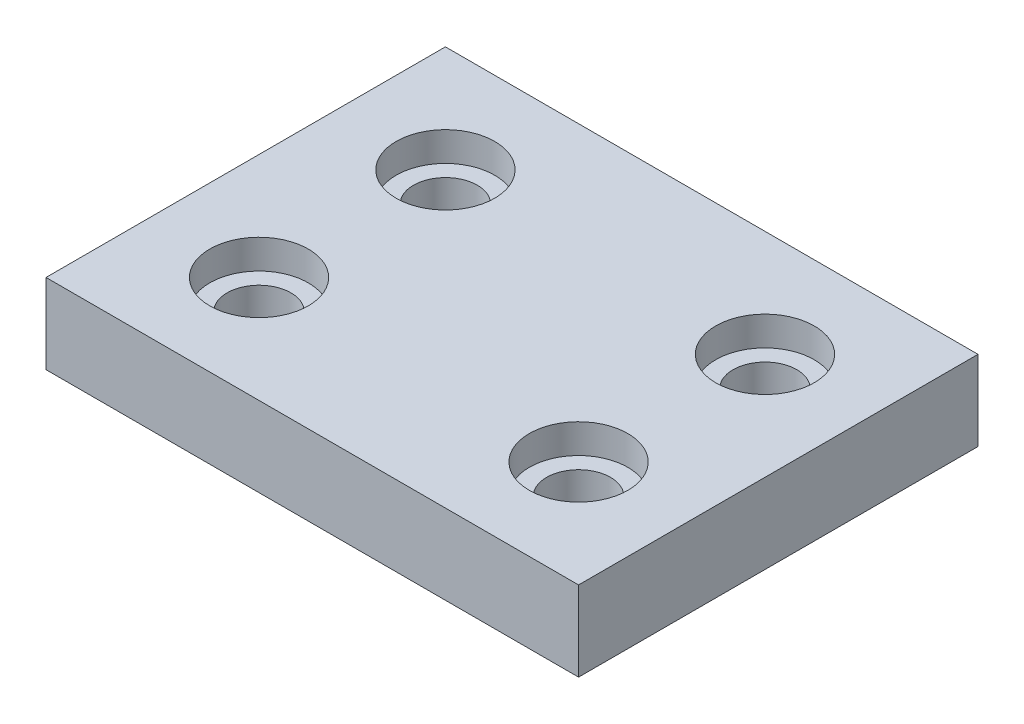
ISO-10303-21;
HEADER;
FILE_DESCRIPTION(('STEP AP214'),'2;1');
FILE_NAME('part.step','',(''),(''),'','','');
FILE_SCHEMA(('AUTOMOTIVE_DESIGN { 1 0 10303 214 1 1 1 1 }'));
ENDSEC;
DATA;
#1=APPLICATION_CONTEXT('core data for automotive mechanical design processes');
#2=APPLICATION_PROTOCOL_DEFINITION('international standard','automotive_design',2000,#1);
#3=PRODUCT_CONTEXT('',#1,'mechanical');
#4=PRODUCT('Part','Part','',(#3));
#5=PRODUCT_RELATED_PRODUCT_CATEGORY('part','',(#4));
#6=PRODUCT_DEFINITION_FORMATION('','',#4);
#7=PRODUCT_DEFINITION_CONTEXT('part definition',#1,'design');
#8=PRODUCT_DEFINITION('design','',#6,#7);
#9=PRODUCT_DEFINITION_SHAPE('','',#8);
#10=(LENGTH_UNIT() NAMED_UNIT(*) SI_UNIT(.MILLI.,.METRE.));
#11=(NAMED_UNIT(*) PLANE_ANGLE_UNIT() SI_UNIT($,.RADIAN.));
#12=(NAMED_UNIT(*) SI_UNIT($,.STERADIAN.) SOLID_ANGLE_UNIT());
#13=UNCERTAINTY_MEASURE_WITH_UNIT(LENGTH_MEASURE(1.E-05),#10,'distance_accuracy_value','');
#14=(GEOMETRIC_REPRESENTATION_CONTEXT(3) GLOBAL_UNCERTAINTY_ASSIGNED_CONTEXT((#13)) GLOBAL_UNIT_ASSIGNED_CONTEXT((#10,
#11,#12)) REPRESENTATION_CONTEXT('',''));
#15=CARTESIAN_POINT('',(0.,0.,0.));
#16=DIRECTION('',(0.,0.,1.));
#17=DIRECTION('',(1.,0.,0.));
#18=AXIS2_PLACEMENT_3D('',#15,#16,#17);
#19=CARTESIAN_POINT('',(50.,15.,37.5));
#20=DIRECTION('',(-1.,0.,0.));
#21=DIRECTION('',(0.,0.,1.));
#22=AXIS2_PLACEMENT_3D('',#19,#20,#21);
#23=PLANE('',#22);
#24=DIRECTION('',(0.,0.,-1.));
#25=VECTOR('',#24,1.);
#26=CARTESIAN_POINT('',(50.,0.,37.5));
#27=LINE('',#26,#25);
#28=CARTESIAN_POINT('',(50.,0.,37.5));
#29=VERTEX_POINT('',#28);
#30=CARTESIAN_POINT('',(50.,0.,-37.5));
#31=VERTEX_POINT('',#30);
#32=EDGE_CURVE('E97',#29,#31,#27,.T.);
#33=ORIENTED_EDGE('',*,*,#32,.T.);
#34=DIRECTION('',(0.,-1.,0.));
#35=VECTOR('',#34,1.);
#36=CARTESIAN_POINT('',(50.,15.,-37.5));
#37=LINE('',#36,#35);
#38=CARTESIAN_POINT('',(50.,15.,-37.5));
#39=VERTEX_POINT('',#38);
#40=EDGE_CURVE('E11',#39,#31,#37,.T.);
#41=ORIENTED_EDGE('',*,*,#40,.F.);
#42=DIRECTION('',(0.,0.,-1.));
#43=VECTOR('',#42,1.);
#44=CARTESIAN_POINT('',(50.,15.,37.5));
#45=LINE('',#44,#43);
#46=CARTESIAN_POINT('',(50.,15.,37.5));
#47=VERTEX_POINT('',#46);
#48=EDGE_CURVE('E85',#47,#39,#45,.T.);
#49=ORIENTED_EDGE('',*,*,#48,.F.);
#50=DIRECTION('',(0.,-1.,0.));
#51=VECTOR('',#50,1.);
#52=CARTESIAN_POINT('',(50.,15.,37.5));
#53=LINE('',#52,#51);
#54=EDGE_CURVE('E93',#47,#29,#53,.T.);
#55=ORIENTED_EDGE('',*,*,#54,.T.);
#56=EDGE_LOOP('',(#33,#41,#49,#55));
#57=FACE_BOUND('',#56,.T.);
#58=ADVANCED_FACE('F34',(#57),#23,.F.);
#59=CARTESIAN_POINT('',(-50.,15.,-37.5));
#60=DIRECTION('',(0.,0.,1.));
#61=DIRECTION('',(1.,0.,0.));
#62=AXIS2_PLACEMENT_3D('',#59,#60,#61);
#63=PLANE('',#62);
#64=DIRECTION('',(-1.,0.,0.));
#65=VECTOR('',#64,1.);
#66=CARTESIAN_POINT('',(-50.,0.,-37.5));
#67=LINE('',#66,#65);
#68=CARTESIAN_POINT('',(-50.,0.,-37.5));
#69=VERTEX_POINT('',#68);
#70=EDGE_CURVE('E89',#31,#69,#67,.T.);
#71=ORIENTED_EDGE('',*,*,#70,.T.);
#72=DIRECTION('',(0.,-1.,0.));
#73=VECTOR('',#72,1.);
#74=CARTESIAN_POINT('',(-50.,15.,-37.5));
#75=LINE('',#74,#73);
#76=CARTESIAN_POINT('',(-50.,15.,-37.5));
#77=VERTEX_POINT('',#76);
#78=EDGE_CURVE('E42',#77,#69,#75,.T.);
#79=ORIENTED_EDGE('',*,*,#78,.F.);
#80=DIRECTION('',(-1.,0.,0.));
#81=VECTOR('',#80,1.);
#82=CARTESIAN_POINT('',(-50.,15.,-37.5));
#83=LINE('',#82,#81);
#84=EDGE_CURVE('E80',#39,#77,#83,.T.);
#85=ORIENTED_EDGE('',*,*,#84,.F.);
#86=ORIENTED_EDGE('',*,*,#40,.T.);
#87=EDGE_LOOP('',(#71,#79,#85,#86));
#88=FACE_BOUND('',#87,.T.);
#89=ADVANCED_FACE('F88',(#88),#63,.F.);
#90=CARTESIAN_POINT('',(-50.,15.,37.5));
#91=DIRECTION('',(1.,0.,0.));
#92=DIRECTION('',(0.,0.,-1.));
#93=AXIS2_PLACEMENT_3D('',#90,#91,#92);
#94=PLANE('',#93);
#95=DIRECTION('',(0.,0.,1.));
#96=VECTOR('',#95,1.);
#97=CARTESIAN_POINT('',(-50.,0.,37.5));
#98=LINE('',#97,#96);
#99=CARTESIAN_POINT('',(-50.,0.,37.5));
#100=VERTEX_POINT('',#99);
#101=EDGE_CURVE('E67',#69,#100,#98,.T.);
#102=ORIENTED_EDGE('',*,*,#101,.T.);
#103=DIRECTION('',(0.,-1.,0.));
#104=VECTOR('',#103,1.);
#105=CARTESIAN_POINT('',(-50.,15.,37.5));
#106=LINE('',#105,#104);
#107=CARTESIAN_POINT('',(-50.,15.,37.5));
#108=VERTEX_POINT('',#107);
#109=EDGE_CURVE('E90',#108,#100,#106,.T.);
#110=ORIENTED_EDGE('',*,*,#109,.F.);
#111=DIRECTION('',(0.,0.,1.));
#112=VECTOR('',#111,1.);
#113=CARTESIAN_POINT('',(-50.,15.,37.5));
#114=LINE('',#113,#112);
#115=EDGE_CURVE('E83',#77,#108,#114,.T.);
#116=ORIENTED_EDGE('',*,*,#115,.F.);
#117=ORIENTED_EDGE('',*,*,#78,.T.);
#118=EDGE_LOOP('',(#102,#110,#116,#117));
#119=FACE_BOUND('',#118,.T.);
#120=ADVANCED_FACE('F91',(#119),#94,.F.);
#121=CARTESIAN_POINT('',(-50.,15.,37.5));
#122=DIRECTION('',(0.,0.,-1.));
#123=DIRECTION('',(-1.,0.,0.));
#124=AXIS2_PLACEMENT_3D('',#121,#122,#123);
#125=PLANE('',#124);
#126=DIRECTION('',(1.,0.,0.));
#127=VECTOR('',#126,1.);
#128=CARTESIAN_POINT('',(-50.,0.,37.5));
#129=LINE('',#128,#127);
#130=EDGE_CURVE('E73',#100,#29,#129,.T.);
#131=ORIENTED_EDGE('',*,*,#130,.T.);
#132=ORIENTED_EDGE('',*,*,#54,.F.);
#133=DIRECTION('',(1.,0.,0.));
#134=VECTOR('',#133,1.);
#135=CARTESIAN_POINT('',(-50.,15.,37.5));
#136=LINE('',#135,#134);
#137=EDGE_CURVE('E50',#108,#47,#136,.T.);
#138=ORIENTED_EDGE('',*,*,#137,.F.);
#139=ORIENTED_EDGE('',*,*,#109,.T.);
#140=EDGE_LOOP('',(#131,#132,#138,#139));
#141=FACE_BOUND('',#140,.T.);
#142=ADVANCED_FACE('F105',(#141),#125,.F.);
#143=CARTESIAN_POINT('',(0.,15.,0.));
#144=DIRECTION('',(0.,-1.,0.));
#145=DIRECTION('',(0.,0.,-1.));
#146=AXIS2_PLACEMENT_3D('',#143,#144,#145);
#147=PLANE('',#146);
#148=CARTESIAN_POINT('',(-30.,15.,17.5));
#149=DIRECTION('',(0.,1.,0.));
#150=DIRECTION('',(0.,0.,1.));
#151=AXIS2_PLACEMENT_3D('',#148,#149,#150);
#152=CIRCLE('',#151,9.24999999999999);
#153=CARTESIAN_POINT('',(-30.,15.,26.75));
#154=VERTEX_POINT('',#153);
#155=EDGE_CURVE('E155',#154,#154,#152,.T.);
#156=ORIENTED_EDGE('',*,*,#155,.F.);
#157=EDGE_LOOP('',(#156));
#158=FACE_BOUND('',#157,.T.);
#159=CARTESIAN_POINT('',(-30.,15.,-17.5));
#160=DIRECTION('',(0.,1.,0.));
#161=DIRECTION('',(0.,0.,1.));
#162=AXIS2_PLACEMENT_3D('',#159,#160,#161);
#163=CIRCLE('',#162,9.24999999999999);
#164=CARTESIAN_POINT('',(-30.,15.,-8.25));
#165=VERTEX_POINT('',#164);
#166=EDGE_CURVE('E143',#165,#165,#163,.T.);
#167=ORIENTED_EDGE('',*,*,#166,.F.);
#168=EDGE_LOOP('',(#167));
#169=FACE_BOUND('',#168,.T.);
#170=CARTESIAN_POINT('',(30.,15.,-17.5));
#171=DIRECTION('',(0.,1.,0.));
#172=DIRECTION('',(0.,0.,1.));
#173=AXIS2_PLACEMENT_3D('',#170,#171,#172);
#174=CIRCLE('',#173,9.25);
#175=CARTESIAN_POINT('',(30.,15.,-8.25));
#176=VERTEX_POINT('',#175);
#177=EDGE_CURVE('E131',#176,#176,#174,.T.);
#178=ORIENTED_EDGE('',*,*,#177,.F.);
#179=EDGE_LOOP('',(#178));
#180=FACE_BOUND('',#179,.T.);
#181=CARTESIAN_POINT('',(30.,15.,17.5));
#182=DIRECTION('',(0.,1.,0.));
#183=DIRECTION('',(0.,0.,1.));
#184=AXIS2_PLACEMENT_3D('',#181,#182,#183);
#185=CIRCLE('',#184,9.25);
#186=CARTESIAN_POINT('',(30.,15.,26.75));
#187=VERTEX_POINT('',#186);
#188=EDGE_CURVE('E119',#187,#187,#185,.T.);
#189=ORIENTED_EDGE('',*,*,#188,.F.);
#190=EDGE_LOOP('',(#189));
#191=FACE_BOUND('',#190,.T.);
#192=ORIENTED_EDGE('',*,*,#48,.T.);
#193=ORIENTED_EDGE('',*,*,#84,.T.);
#194=ORIENTED_EDGE('',*,*,#115,.T.);
#195=ORIENTED_EDGE('',*,*,#137,.T.);
#196=EDGE_LOOP('',(#192,#193,#194,#195));
#197=FACE_BOUND('',#196,.T.);
#198=ADVANCED_FACE('F81',(#158,#169,#180,#191,#197),#147,.F.);
#199=CARTESIAN_POINT('',(0.,0.,0.));
#200=DIRECTION('',(0.,-1.,0.));
#201=DIRECTION('',(0.,0.,-1.));
#202=AXIS2_PLACEMENT_3D('',#199,#200,#201);
#203=PLANE('',#202);
#204=CARTESIAN_POINT('',(-30.,0.,17.5));
#205=DIRECTION('',(0.,1.,0.));
#206=DIRECTION('',(0.,0.,1.));
#207=AXIS2_PLACEMENT_3D('',#204,#205,#206);
#208=CIRCLE('',#207,5.99999999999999);
#209=CARTESIAN_POINT('',(-30.,0.,23.5));
#210=VERTEX_POINT('',#209);
#211=EDGE_CURVE('E146',#210,#210,#208,.T.);
#212=ORIENTED_EDGE('',*,*,#211,.T.);
#213=EDGE_LOOP('',(#212));
#214=FACE_BOUND('',#213,.T.);
#215=CARTESIAN_POINT('',(-30.,0.,-17.5));
#216=DIRECTION('',(0.,1.,0.));
#217=DIRECTION('',(0.,0.,1.));
#218=AXIS2_PLACEMENT_3D('',#215,#216,#217);
#219=CIRCLE('',#218,6.);
#220=CARTESIAN_POINT('',(-30.,0.,-11.5));
#221=VERTEX_POINT('',#220);
#222=EDGE_CURVE('E134',#221,#221,#219,.T.);
#223=ORIENTED_EDGE('',*,*,#222,.T.);
#224=EDGE_LOOP('',(#223));
#225=FACE_BOUND('',#224,.T.);
#226=CARTESIAN_POINT('',(30.,0.,-17.5));
#227=DIRECTION('',(0.,1.,0.));
#228=DIRECTION('',(0.,0.,1.));
#229=AXIS2_PLACEMENT_3D('',#226,#227,#228);
#230=CIRCLE('',#229,5.99999999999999);
#231=CARTESIAN_POINT('',(30.,0.,-11.5));
#232=VERTEX_POINT('',#231);
#233=EDGE_CURVE('E122',#232,#232,#230,.T.);
#234=ORIENTED_EDGE('',*,*,#233,.T.);
#235=EDGE_LOOP('',(#234));
#236=FACE_BOUND('',#235,.T.);
#237=CARTESIAN_POINT('',(30.,0.,17.5));
#238=DIRECTION('',(0.,1.,0.));
#239=DIRECTION('',(0.,0.,1.));
#240=AXIS2_PLACEMENT_3D('',#237,#238,#239);
#241=CIRCLE('',#240,5.99999999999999);
#242=CARTESIAN_POINT('',(30.,0.,23.5));
#243=VERTEX_POINT('',#242);
#244=EDGE_CURVE('E100',#243,#243,#241,.T.);
#245=ORIENTED_EDGE('',*,*,#244,.T.);
#246=EDGE_LOOP('',(#245));
#247=FACE_BOUND('',#246,.T.);
#248=ORIENTED_EDGE('',*,*,#32,.F.);
#249=ORIENTED_EDGE('',*,*,#130,.F.);
#250=ORIENTED_EDGE('',*,*,#101,.F.);
#251=ORIENTED_EDGE('',*,*,#70,.F.);
#252=EDGE_LOOP('',(#248,#249,#250,#251));
#253=FACE_BOUND('',#252,.T.);
#254=ADVANCED_FACE('F108',(#214,#225,#236,#247,#253),#203,.T.);
#255=CARTESIAN_POINT('',(30.,15.,17.5));
#256=DIRECTION('',(0.,1.,0.));
#257=DIRECTION('',(0.,0.,1.));
#258=AXIS2_PLACEMENT_3D('',#255,#256,#257);
#259=CYLINDRICAL_SURFACE('',#258,5.99999999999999);
#260=ORIENTED_EDGE('',*,*,#244,.F.);
#261=EDGE_LOOP('',(#260));
#262=FACE_BOUND('',#261,.T.);
#263=CARTESIAN_POINT('',(30.,9.5,17.5));
#264=DIRECTION('',(0.,1.,0.));
#265=DIRECTION('',(0.,0.,1.));
#266=AXIS2_PLACEMENT_3D('',#263,#264,#265);
#267=CIRCLE('',#266,5.99999999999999);
#268=CARTESIAN_POINT('',(30.,9.5,23.5));
#269=VERTEX_POINT('',#268);
#270=EDGE_CURVE('E113',#269,#269,#267,.T.);
#271=ORIENTED_EDGE('',*,*,#270,.T.);
#272=EDGE_LOOP('',(#271));
#273=FACE_BOUND('',#272,.T.);
#274=ADVANCED_FACE('F183',(#262,#273),#259,.F.);
#275=CARTESIAN_POINT('',(36.,9.5,17.5));
#276=DIRECTION('',(0.,-1.,0.));
#277=DIRECTION('',(0.,0.,-1.));
#278=AXIS2_PLACEMENT_3D('',#275,#276,#277);
#279=PLANE('',#278);
#280=ORIENTED_EDGE('',*,*,#270,.F.);
#281=EDGE_LOOP('',(#280));
#282=FACE_BOUND('',#281,.T.);
#283=CARTESIAN_POINT('',(30.,9.5,17.5));
#284=DIRECTION('',(0.,1.,0.));
#285=DIRECTION('',(0.,0.,1.));
#286=AXIS2_PLACEMENT_3D('',#283,#284,#285);
#287=CIRCLE('',#286,9.25);
#288=CARTESIAN_POINT('',(30.,9.5,26.75));
#289=VERTEX_POINT('',#288);
#290=EDGE_CURVE('E116',#289,#289,#287,.T.);
#291=ORIENTED_EDGE('',*,*,#290,.T.);
#292=EDGE_LOOP('',(#291));
#293=FACE_BOUND('',#292,.T.);
#294=ADVANCED_FACE('F173',(#282,#293),#279,.F.);
#295=CARTESIAN_POINT('',(30.,15.,17.5));
#296=DIRECTION('',(0.,1.,0.));
#297=DIRECTION('',(0.,0.,1.));
#298=AXIS2_PLACEMENT_3D('',#295,#296,#297);
#299=CYLINDRICAL_SURFACE('',#298,9.25);
#300=ORIENTED_EDGE('',*,*,#290,.F.);
#301=EDGE_LOOP('',(#300));
#302=FACE_BOUND('',#301,.T.);
#303=ORIENTED_EDGE('',*,*,#188,.T.);
#304=EDGE_LOOP('',(#303));
#305=FACE_BOUND('',#304,.T.);
#306=ADVANCED_FACE('F170',(#302,#305),#299,.F.);
#307=CARTESIAN_POINT('',(30.,15.,-17.5));
#308=DIRECTION('',(0.,1.,0.));
#309=DIRECTION('',(0.,0.,1.));
#310=AXIS2_PLACEMENT_3D('',#307,#308,#309);
#311=CYLINDRICAL_SURFACE('',#310,5.99999999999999);
#312=ORIENTED_EDGE('',*,*,#233,.F.);
#313=EDGE_LOOP('',(#312));
#314=FACE_BOUND('',#313,.T.);
#315=CARTESIAN_POINT('',(30.,9.5,-17.5));
#316=DIRECTION('',(0.,1.,0.));
#317=DIRECTION('',(0.,0.,1.));
#318=AXIS2_PLACEMENT_3D('',#315,#316,#317);
#319=CIRCLE('',#318,5.99999999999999);
#320=CARTESIAN_POINT('',(30.,9.5,-11.5));
#321=VERTEX_POINT('',#320);
#322=EDGE_CURVE('E125',#321,#321,#319,.T.);
#323=ORIENTED_EDGE('',*,*,#322,.T.);
#324=EDGE_LOOP('',(#323));
#325=FACE_BOUND('',#324,.T.);
#326=ADVANCED_FACE('F172',(#314,#325),#311,.F.);
#327=CARTESIAN_POINT('',(36.,9.5,-17.5));
#328=DIRECTION('',(0.,-1.,0.));
#329=DIRECTION('',(0.,0.,-1.));
#330=AXIS2_PLACEMENT_3D('',#327,#328,#329);
#331=PLANE('',#330);
#332=ORIENTED_EDGE('',*,*,#322,.F.);
#333=EDGE_LOOP('',(#332));
#334=FACE_BOUND('',#333,.T.);
#335=CARTESIAN_POINT('',(30.,9.5,-17.5));
#336=DIRECTION('',(0.,1.,0.));
#337=DIRECTION('',(0.,0.,1.));
#338=AXIS2_PLACEMENT_3D('',#335,#336,#337);
#339=CIRCLE('',#338,9.25);
#340=CARTESIAN_POINT('',(30.,9.5,-8.25));
#341=VERTEX_POINT('',#340);
#342=EDGE_CURVE('E128',#341,#341,#339,.T.);
#343=ORIENTED_EDGE('',*,*,#342,.T.);
#344=EDGE_LOOP('',(#343));
#345=FACE_BOUND('',#344,.T.);
#346=ADVANCED_FACE('F180',(#334,#345),#331,.F.);
#347=CARTESIAN_POINT('',(30.,15.,-17.5));
#348=DIRECTION('',(0.,1.,0.));
#349=DIRECTION('',(0.,0.,1.));
#350=AXIS2_PLACEMENT_3D('',#347,#348,#349);
#351=CYLINDRICAL_SURFACE('',#350,9.25);
#352=ORIENTED_EDGE('',*,*,#342,.F.);
#353=EDGE_LOOP('',(#352));
#354=FACE_BOUND('',#353,.T.);
#355=ORIENTED_EDGE('',*,*,#177,.T.);
#356=EDGE_LOOP('',(#355));
#357=FACE_BOUND('',#356,.T.);
#358=ADVANCED_FACE('F235',(#354,#357),#351,.F.);
#359=CARTESIAN_POINT('',(-30.,15.,-17.5));
#360=DIRECTION('',(0.,1.,0.));
#361=DIRECTION('',(0.,0.,1.));
#362=AXIS2_PLACEMENT_3D('',#359,#360,#361);
#363=CYLINDRICAL_SURFACE('',#362,6.);
#364=ORIENTED_EDGE('',*,*,#222,.F.);
#365=EDGE_LOOP('',(#364));
#366=FACE_BOUND('',#365,.T.);
#367=CARTESIAN_POINT('',(-30.,9.5,-17.5));
#368=DIRECTION('',(0.,1.,0.));
#369=DIRECTION('',(0.,0.,1.));
#370=AXIS2_PLACEMENT_3D('',#367,#368,#369);
#371=CIRCLE('',#370,6.);
#372=CARTESIAN_POINT('',(-30.,9.5,-11.5));
#373=VERTEX_POINT('',#372);
#374=EDGE_CURVE('E137',#373,#373,#371,.T.);
#375=ORIENTED_EDGE('',*,*,#374,.T.);
#376=EDGE_LOOP('',(#375));
#377=FACE_BOUND('',#376,.T.);
#378=ADVANCED_FACE('F245',(#366,#377),#363,.F.);
#379=CARTESIAN_POINT('',(-24.,9.5,-17.5));
#380=DIRECTION('',(0.,-1.,0.));
#381=DIRECTION('',(0.,0.,-1.));
#382=AXIS2_PLACEMENT_3D('',#379,#380,#381);
#383=PLANE('',#382);
#384=ORIENTED_EDGE('',*,*,#374,.F.);
#385=EDGE_LOOP('',(#384));
#386=FACE_BOUND('',#385,.T.);
#387=CARTESIAN_POINT('',(-30.,9.5,-17.5));
#388=DIRECTION('',(0.,1.,0.));
#389=DIRECTION('',(0.,0.,1.));
#390=AXIS2_PLACEMENT_3D('',#387,#388,#389);
#391=CIRCLE('',#390,9.24999999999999);
#392=CARTESIAN_POINT('',(-30.,9.5,-8.25));
#393=VERTEX_POINT('',#392);
#394=EDGE_CURVE('E140',#393,#393,#391,.T.);
#395=ORIENTED_EDGE('',*,*,#394,.T.);
#396=EDGE_LOOP('',(#395));
#397=FACE_BOUND('',#396,.T.);
#398=ADVANCED_FACE('F255',(#386,#397),#383,.F.);
#399=CARTESIAN_POINT('',(-30.,15.,-17.5));
#400=DIRECTION('',(0.,1.,0.));
#401=DIRECTION('',(0.,0.,1.));
#402=AXIS2_PLACEMENT_3D('',#399,#400,#401);
#403=CYLINDRICAL_SURFACE('',#402,9.24999999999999);
#404=ORIENTED_EDGE('',*,*,#394,.F.);
#405=EDGE_LOOP('',(#404));
#406=FACE_BOUND('',#405,.T.);
#407=ORIENTED_EDGE('',*,*,#166,.T.);
#408=EDGE_LOOP('',(#407));
#409=FACE_BOUND('',#408,.T.);
#410=ADVANCED_FACE('F265',(#406,#409),#403,.F.);
#411=CARTESIAN_POINT('',(-30.,15.,17.5));
#412=DIRECTION('',(0.,1.,0.));
#413=DIRECTION('',(0.,0.,1.));
#414=AXIS2_PLACEMENT_3D('',#411,#412,#413);
#415=CYLINDRICAL_SURFACE('',#414,6.);
#416=ORIENTED_EDGE('',*,*,#211,.F.);
#417=EDGE_LOOP('',(#416));
#418=FACE_BOUND('',#417,.T.);
#419=CARTESIAN_POINT('',(-30.,9.5,17.5));
#420=DIRECTION('',(0.,1.,0.));
#421=DIRECTION('',(0.,0.,1.));
#422=AXIS2_PLACEMENT_3D('',#419,#420,#421);
#423=CIRCLE('',#422,6.);
#424=CARTESIAN_POINT('',(-30.,9.5,23.5));
#425=VERTEX_POINT('',#424);
#426=EDGE_CURVE('E149',#425,#425,#423,.T.);
#427=ORIENTED_EDGE('',*,*,#426,.T.);
#428=EDGE_LOOP('',(#427));
#429=FACE_BOUND('',#428,.T.);
#430=ADVANCED_FACE('F275',(#418,#429),#415,.F.);
#431=CARTESIAN_POINT('',(-24.,9.5,17.5));
#432=DIRECTION('',(0.,-1.,0.));
#433=DIRECTION('',(0.,0.,-1.));
#434=AXIS2_PLACEMENT_3D('',#431,#432,#433);
#435=PLANE('',#434);
#436=ORIENTED_EDGE('',*,*,#426,.F.);
#437=EDGE_LOOP('',(#436));
#438=FACE_BOUND('',#437,.T.);
#439=CARTESIAN_POINT('',(-30.,9.5,17.5));
#440=DIRECTION('',(0.,1.,0.));
#441=DIRECTION('',(0.,0.,1.));
#442=AXIS2_PLACEMENT_3D('',#439,#440,#441);
#443=CIRCLE('',#442,9.25);
#444=CARTESIAN_POINT('',(-30.,9.5,26.75));
#445=VERTEX_POINT('',#444);
#446=EDGE_CURVE('E152',#445,#445,#443,.T.);
#447=ORIENTED_EDGE('',*,*,#446,.T.);
#448=EDGE_LOOP('',(#447));
#449=FACE_BOUND('',#448,.T.);
#450=ADVANCED_FACE('F285',(#438,#449),#435,.F.);
#451=CARTESIAN_POINT('',(-30.,15.,17.5));
#452=DIRECTION('',(0.,1.,0.));
#453=DIRECTION('',(0.,0.,1.));
#454=AXIS2_PLACEMENT_3D('',#451,#452,#453);
#455=CYLINDRICAL_SURFACE('',#454,9.25);
#456=ORIENTED_EDGE('',*,*,#446,.F.);
#457=EDGE_LOOP('',(#456));
#458=FACE_BOUND('',#457,.T.);
#459=ORIENTED_EDGE('',*,*,#155,.T.);
#460=EDGE_LOOP('',(#459));
#461=FACE_BOUND('',#460,.T.);
#462=ADVANCED_FACE('F159',(#458,#461),#455,.F.);
#463=CLOSED_SHELL('',(#58,#89,#120,#142,#198,#254,#274,#294,#306,#326,#346,#358,#378,#398,#410,
#430,#450,#462));
#464=MANIFOLD_SOLID_BREP('B2',#463);
#465=ADVANCED_BREP_SHAPE_REPRESENTATION('',(#18,#464),#14);
#466=SHAPE_DEFINITION_REPRESENTATION(#9,#465);
ENDSEC;
END-ISO-10303-21;
